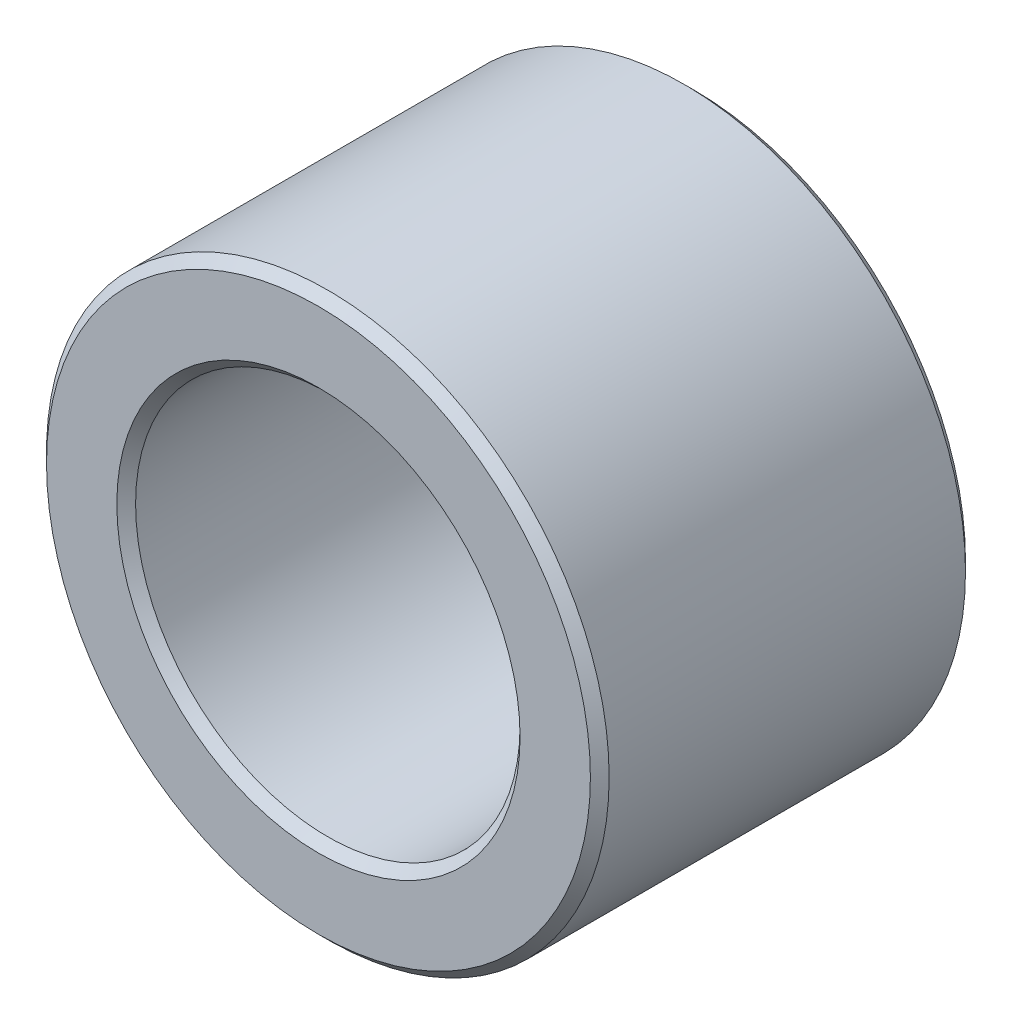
ISO-10303-21;
HEADER;
FILE_DESCRIPTION(('STEP AP214'),'2;1');
FILE_NAME('part.step','',(''),(''),'','','');
FILE_SCHEMA(('AUTOMOTIVE_DESIGN { 1 0 10303 214 1 1 1 1 }'));
ENDSEC;
DATA;
#1=APPLICATION_CONTEXT('core data for automotive mechanical design processes');
#2=APPLICATION_PROTOCOL_DEFINITION('international standard','automotive_design',2000,#1);
#3=PRODUCT_CONTEXT('',#1,'mechanical');
#4=PRODUCT('Part','Part','',(#3));
#5=PRODUCT_RELATED_PRODUCT_CATEGORY('part','',(#4));
#6=PRODUCT_DEFINITION_FORMATION('','',#4);
#7=PRODUCT_DEFINITION_CONTEXT('part definition',#1,'design');
#8=PRODUCT_DEFINITION('design','',#6,#7);
#9=PRODUCT_DEFINITION_SHAPE('','',#8);
#10=(LENGTH_UNIT() NAMED_UNIT(*) SI_UNIT(.MILLI.,.METRE.));
#11=(NAMED_UNIT(*) PLANE_ANGLE_UNIT() SI_UNIT($,.RADIAN.));
#12=(NAMED_UNIT(*) SI_UNIT($,.STERADIAN.) SOLID_ANGLE_UNIT());
#13=UNCERTAINTY_MEASURE_WITH_UNIT(LENGTH_MEASURE(1.E-05),#10,'distance_accuracy_value','');
#14=(GEOMETRIC_REPRESENTATION_CONTEXT(3) GLOBAL_UNCERTAINTY_ASSIGNED_CONTEXT((#13)) GLOBAL_UNIT_ASSIGNED_CONTEXT((#10,
#11,#12)) REPRESENTATION_CONTEXT('',''));
#15=CARTESIAN_POINT('',(0.,0.,0.));
#16=DIRECTION('',(0.,0.,1.));
#17=DIRECTION('',(1.,0.,0.));
#18=AXIS2_PLACEMENT_3D('',#15,#16,#17);
#19=CARTESIAN_POINT('',(0.,0.,4.));
#20=DIRECTION('',(0.,0.,1.));
#21=DIRECTION('',(1.,0.,0.));
#22=AXIS2_PLACEMENT_3D('',#19,#20,#21);
#23=PLANE('',#22);
#24=CARTESIAN_POINT('',(0.,0.,4.));
#25=DIRECTION('',(0.,0.,1.));
#26=DIRECTION('',(1.,0.,0.));
#27=AXIS2_PLACEMENT_3D('',#24,#25,#26);
#28=CIRCLE('',#27,4.3);
#29=CARTESIAN_POINT('',(4.3,0.,4.));
#30=VERTEX_POINT('',#29);
#31=EDGE_CURVE('E10',#30,#30,#28,.F.);
#32=ORIENTED_EDGE('',*,*,#31,.T.);
#33=EDGE_LOOP('',(#32));
#34=FACE_BOUND('',#33,.T.);
#35=CARTESIAN_POINT('',(0.,0.,4.));
#36=DIRECTION('',(0.,0.,1.));
#37=DIRECTION('',(1.,0.,0.));
#38=AXIS2_PLACEMENT_3D('',#35,#36,#37);
#39=CIRCLE('',#38,5.8);
#40=CARTESIAN_POINT('',(5.8,0.,4.));
#41=VERTEX_POINT('',#40);
#42=EDGE_CURVE('E45',#41,#41,#39,.T.);
#43=ORIENTED_EDGE('',*,*,#42,.T.);
#44=EDGE_LOOP('',(#43));
#45=FACE_BOUND('',#44,.T.);
#46=ADVANCED_FACE('F37',(#34,#45),#23,.T.);
#47=CARTESIAN_POINT('',(0.,0.,-4.));
#48=DIRECTION('',(0.,0.,1.));
#49=DIRECTION('',(1.,0.,0.));
#50=AXIS2_PLACEMENT_3D('',#47,#48,#49);
#51=PLANE('',#50);
#52=CARTESIAN_POINT('',(0.,0.,-4.));
#53=DIRECTION('',(0.,0.,1.));
#54=DIRECTION('',(1.,0.,0.));
#55=AXIS2_PLACEMENT_3D('',#52,#53,#54);
#56=CIRCLE('',#55,5.8);
#57=CARTESIAN_POINT('',(5.8,0.,-4.));
#58=VERTEX_POINT('',#57);
#59=EDGE_CURVE('E62',#58,#58,#56,.F.);
#60=ORIENTED_EDGE('',*,*,#59,.T.);
#61=EDGE_LOOP('',(#60));
#62=FACE_BOUND('',#61,.T.);
#63=CARTESIAN_POINT('',(0.,0.,-4.));
#64=DIRECTION('',(0.,0.,1.));
#65=DIRECTION('',(1.,0.,0.));
#66=AXIS2_PLACEMENT_3D('',#63,#64,#65);
#67=CIRCLE('',#66,4.3);
#68=CARTESIAN_POINT('',(-4.3,0.,-4.));
#69=VERTEX_POINT('',#68);
#70=EDGE_CURVE('E66',#69,#69,#67,.T.);
#71=ORIENTED_EDGE('',*,*,#70,.T.);
#72=EDGE_LOOP('',(#71));
#73=FACE_BOUND('',#72,.T.);
#74=ADVANCED_FACE('F89',(#62,#73),#51,.F.);
#75=CARTESIAN_POINT('',(0.,0.,4.));
#76=DIRECTION('',(0.,0.,-1.));
#77=DIRECTION('',(-1.,0.,0.));
#78=AXIS2_PLACEMENT_3D('',#75,#76,#77);
#79=CYLINDRICAL_SURFACE('',#78,6.);
#80=CARTESIAN_POINT('',(0.,0.,-3.8));
#81=DIRECTION('',(0.,0.,1.));
#82=DIRECTION('',(1.,0.,0.));
#83=AXIS2_PLACEMENT_3D('',#80,#81,#82);
#84=CIRCLE('',#83,6.);
#85=CARTESIAN_POINT('',(6.,0.,-3.8));
#86=VERTEX_POINT('',#85);
#87=EDGE_CURVE('E70',#86,#86,#84,.T.);
#88=ORIENTED_EDGE('',*,*,#87,.T.);
#89=EDGE_LOOP('',(#88));
#90=FACE_BOUND('',#89,.T.);
#91=CARTESIAN_POINT('',(0.,0.,3.8));
#92=DIRECTION('',(0.,0.,1.));
#93=DIRECTION('',(1.,0.,0.));
#94=AXIS2_PLACEMENT_3D('',#91,#92,#93);
#95=CIRCLE('',#94,6.);
#96=CARTESIAN_POINT('',(6.,0.,3.8));
#97=VERTEX_POINT('',#96);
#98=EDGE_CURVE('E74',#97,#97,#95,.F.);
#99=ORIENTED_EDGE('',*,*,#98,.T.);
#100=EDGE_LOOP('',(#99));
#101=FACE_BOUND('',#100,.T.);
#102=ADVANCED_FACE('F78',(#90,#101),#79,.T.);
#103=CARTESIAN_POINT('',(0.,0.,4.));
#104=DIRECTION('',(0.,0.,-1.));
#105=DIRECTION('',(-1.,0.,0.));
#106=AXIS2_PLACEMENT_3D('',#103,#104,#105);
#107=CYLINDRICAL_SURFACE('',#106,4.1);
#108=CARTESIAN_POINT('',(0.,0.,-3.8));
#109=DIRECTION('',(0.,0.,1.));
#110=DIRECTION('',(1.,0.,0.));
#111=AXIS2_PLACEMENT_3D('',#108,#109,#110);
#112=CIRCLE('',#111,4.1);
#113=CARTESIAN_POINT('',(-4.1,0.,-3.8));
#114=VERTEX_POINT('',#113);
#115=EDGE_CURVE('E51',#114,#114,#112,.F.);
#116=ORIENTED_EDGE('',*,*,#115,.T.);
#117=EDGE_LOOP('',(#116));
#118=FACE_BOUND('',#117,.T.);
#119=CARTESIAN_POINT('',(0.,0.,3.8));
#120=DIRECTION('',(0.,0.,1.));
#121=DIRECTION('',(1.,0.,0.));
#122=AXIS2_PLACEMENT_3D('',#119,#120,#121);
#123=CIRCLE('',#122,4.1);
#124=CARTESIAN_POINT('',(4.1,0.,3.8));
#125=VERTEX_POINT('',#124);
#126=EDGE_CURVE('E57',#125,#125,#123,.T.);
#127=ORIENTED_EDGE('',*,*,#126,.T.);
#128=EDGE_LOOP('',(#127));
#129=FACE_BOUND('',#128,.T.);
#130=ADVANCED_FACE('F97',(#118,#129),#107,.F.);
#131=CARTESIAN_POINT('',(0.,0.,-3.8));
#132=DIRECTION('',(0.,0.,1.));
#133=DIRECTION('',(1.,0.,0.));
#134=AXIS2_PLACEMENT_3D('',#131,#132,#133);
#135=CONICAL_SURFACE('',#134,6.,0.78539816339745);
#136=ORIENTED_EDGE('',*,*,#59,.F.);
#137=EDGE_LOOP('',(#136));
#138=FACE_BOUND('',#137,.T.);
#139=ORIENTED_EDGE('',*,*,#87,.F.);
#140=EDGE_LOOP('',(#139));
#141=FACE_BOUND('',#140,.T.);
#142=ADVANCED_FACE('F102',(#138,#141),#135,.T.);
#143=CARTESIAN_POINT('',(0.,0.,-4.));
#144=DIRECTION('',(0.,0.,-1.));
#145=DIRECTION('',(-1.,0.,0.));
#146=AXIS2_PLACEMENT_3D('',#143,#144,#145);
#147=CONICAL_SURFACE('',#146,4.3,0.785398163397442);
#148=CARTESIAN_POINT('',(-4.1,0.,-3.8));
#149=CARTESIAN_POINT('',(-4.10208333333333,0.,-3.80208333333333));
#150=CARTESIAN_POINT('',(-4.10416666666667,0.,-3.80416666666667));
#151=CARTESIAN_POINT('',(-4.10833333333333,0.,-3.80833333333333));
#152=CARTESIAN_POINT('',(-4.11041666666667,0.,-3.81041666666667));
#153=CARTESIAN_POINT('',(-4.11458333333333,0.,-3.81458333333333));
#154=CARTESIAN_POINT('',(-4.11666666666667,0.,-3.81666666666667));
#155=CARTESIAN_POINT('',(-4.12083333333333,0.,-3.82083333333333));
#156=CARTESIAN_POINT('',(-4.12291666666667,0.,-3.82291666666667));
#157=CARTESIAN_POINT('',(-4.12708333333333,0.,-3.82708333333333));
#158=CARTESIAN_POINT('',(-4.12916666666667,0.,-3.82916666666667));
#159=CARTESIAN_POINT('',(-4.13333333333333,0.,-3.83333333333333));
#160=CARTESIAN_POINT('',(-4.13541666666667,0.,-3.83541666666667));
#161=CARTESIAN_POINT('',(-4.13958333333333,0.,-3.83958333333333));
#162=CARTESIAN_POINT('',(-4.14166666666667,0.,-3.84166666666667));
#163=CARTESIAN_POINT('',(-4.14583333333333,0.,-3.84583333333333));
#164=CARTESIAN_POINT('',(-4.14791666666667,0.,-3.84791666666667));
#165=CARTESIAN_POINT('',(-4.15208333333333,0.,-3.85208333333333));
#166=CARTESIAN_POINT('',(-4.15416666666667,0.,-3.85416666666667));
#167=CARTESIAN_POINT('',(-4.15833333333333,0.,-3.85833333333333));
#168=CARTESIAN_POINT('',(-4.16041666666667,0.,-3.86041666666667));
#169=CARTESIAN_POINT('',(-4.16458333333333,0.,-3.86458333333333));
#170=CARTESIAN_POINT('',(-4.16666666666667,0.,-3.86666666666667));
#171=CARTESIAN_POINT('',(-4.17083333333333,0.,-3.87083333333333));
#172=CARTESIAN_POINT('',(-4.17291666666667,0.,-3.87291666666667));
#173=CARTESIAN_POINT('',(-4.17708333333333,0.,-3.87708333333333));
#174=CARTESIAN_POINT('',(-4.17916666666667,0.,-3.87916666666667));
#175=CARTESIAN_POINT('',(-4.18333333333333,0.,-3.88333333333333));
#176=CARTESIAN_POINT('',(-4.18541666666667,0.,-3.88541666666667));
#177=CARTESIAN_POINT('',(-4.18958333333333,0.,-3.88958333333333));
#178=CARTESIAN_POINT('',(-4.19166666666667,0.,-3.89166666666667));
#179=CARTESIAN_POINT('',(-4.19583333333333,0.,-3.89583333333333));
#180=CARTESIAN_POINT('',(-4.19791666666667,0.,-3.89791666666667));
#181=CARTESIAN_POINT('',(-4.20208333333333,0.,-3.90208333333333));
#182=CARTESIAN_POINT('',(-4.20416666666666,0.,-3.90416666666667));
#183=CARTESIAN_POINT('',(-4.20833333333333,0.,-3.90833333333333));
#184=CARTESIAN_POINT('',(-4.21041666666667,0.,-3.91041666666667));
#185=CARTESIAN_POINT('',(-4.21458333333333,0.,-3.91458333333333));
#186=CARTESIAN_POINT('',(-4.21666666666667,0.,-3.91666666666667));
#187=CARTESIAN_POINT('',(-4.22083333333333,0.,-3.92083333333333));
#188=CARTESIAN_POINT('',(-4.22291666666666,0.,-3.92291666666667));
#189=CARTESIAN_POINT('',(-4.22708333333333,0.,-3.92708333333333));
#190=CARTESIAN_POINT('',(-4.22916666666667,0.,-3.92916666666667));
#191=CARTESIAN_POINT('',(-4.23333333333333,0.,-3.93333333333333));
#192=CARTESIAN_POINT('',(-4.23541666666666,0.,-3.93541666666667));
#193=CARTESIAN_POINT('',(-4.23958333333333,0.,-3.93958333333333));
#194=CARTESIAN_POINT('',(-4.24166666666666,0.,-3.94166666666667));
#195=CARTESIAN_POINT('',(-4.24583333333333,0.,-3.94583333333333));
#196=CARTESIAN_POINT('',(-4.24791666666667,0.,-3.94791666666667));
#197=CARTESIAN_POINT('',(-4.25208333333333,0.,-3.95208333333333));
#198=CARTESIAN_POINT('',(-4.25416666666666,0.,-3.95416666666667));
#199=CARTESIAN_POINT('',(-4.25833333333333,0.,-3.95833333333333));
#200=CARTESIAN_POINT('',(-4.26041666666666,0.,-3.96041666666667));
#201=CARTESIAN_POINT('',(-4.26458333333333,0.,-3.96458333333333));
#202=CARTESIAN_POINT('',(-4.26666666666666,0.,-3.96666666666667));
#203=CARTESIAN_POINT('',(-4.27083333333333,0.,-3.97083333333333));
#204=CARTESIAN_POINT('',(-4.27291666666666,0.,-3.97291666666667));
#205=CARTESIAN_POINT('',(-4.27708333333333,0.,-3.97708333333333));
#206=CARTESIAN_POINT('',(-4.27916666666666,0.,-3.97916666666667));
#207=CARTESIAN_POINT('',(-4.28333333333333,0.,-3.98333333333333));
#208=CARTESIAN_POINT('',(-4.28541666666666,0.,-3.98541666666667));
#209=CARTESIAN_POINT('',(-4.28958333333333,0.,-3.98958333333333));
#210=CARTESIAN_POINT('',(-4.29166666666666,0.,-3.99166666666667));
#211=CARTESIAN_POINT('',(-4.29583333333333,0.,-3.99583333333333));
#212=CARTESIAN_POINT('',(-4.29791666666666,0.,-3.99791666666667));
#213=CARTESIAN_POINT('',(-4.3,0.,-4.));
#214=B_SPLINE_CURVE_WITH_KNOTS('',3,(#148,#149,#150,#151,#152,#153,#154,#155,#156,#157,#158,
#159,#160,#161,#162,#163,#164,#165,#166,#167,#168,#169,#170,#171,#172,#173,#174,#175,#176,#177,
#178,#179,#180,#181,#182,#183,#184,#185,#186,#187,#188,#189,#190,#191,#192,#193,#194,#195,#196,
#197,#198,#199,#200,#201,#202,#203,#204,#205,#206,#207,#208,#209,#210,#211,#212,#213),
.UNSPECIFIED.,.F.,.F.,(4,2,2,2,2,2,2,2,2,2,2,2,2,2,2,2,2,2,2,2,2,2,2,2,2,2,2,2,2,2,2,2,4),(0.,
0.00883883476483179,0.0176776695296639,0.0265165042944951,0.0353553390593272,0.044194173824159,
0.0530330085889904,0.0618718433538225,0.0707106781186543,0.0795495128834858,0.0883883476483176,
0.0972271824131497,0.106066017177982,0.114904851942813,0.123743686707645,0.132582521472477,
0.141421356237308,0.15026019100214,0.159099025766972,0.167937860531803,0.176776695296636,
0.185615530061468,0.1944543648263,0.203293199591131,0.212132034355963,0.220970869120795,
0.229809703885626,0.238648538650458,0.24748737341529,0.256326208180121,0.265165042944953,
0.274003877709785,0.282842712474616),.UNSPECIFIED.);
#215=EDGE_CURVE('BSEAM86',#114,#69,#214,.T.);
#216=ORIENTED_EDGE('',*,*,#115,.F.);
#217=ORIENTED_EDGE('',*,*,#70,.F.);
#218=ORIENTED_EDGE('',*,*,#215,.T.);
#219=ORIENTED_EDGE('',*,*,#215,.F.);
#220=EDGE_LOOP('',(#216,#218,#217,#219));
#221=FACE_BOUND('',#220,.T.);
#222=ADVANCED_FACE('F86',(#221),#147,.F.);
#223=CARTESIAN_POINT('',(0.,0.,3.8));
#224=DIRECTION('',(0.,0.,1.));
#225=DIRECTION('',(1.,0.,0.));
#226=AXIS2_PLACEMENT_3D('',#223,#224,#225);
#227=CONICAL_SURFACE('',#226,4.1,0.78539816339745);
#228=ORIENTED_EDGE('',*,*,#31,.F.);
#229=EDGE_LOOP('',(#228));
#230=FACE_BOUND('',#229,.T.);
#231=ORIENTED_EDGE('',*,*,#126,.F.);
#232=EDGE_LOOP('',(#231));
#233=FACE_BOUND('',#232,.T.);
#234=ADVANCED_FACE('F82',(#230,#233),#227,.F.);
#235=CARTESIAN_POINT('',(0.,0.,4.));
#236=DIRECTION('',(0.,0.,-1.));
#237=DIRECTION('',(-1.,0.,0.));
#238=AXIS2_PLACEMENT_3D('',#235,#236,#237);
#239=CONICAL_SURFACE('',#238,5.8,0.785398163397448);
#240=ORIENTED_EDGE('',*,*,#98,.F.);
#241=EDGE_LOOP('',(#240));
#242=FACE_BOUND('',#241,.T.);
#243=ORIENTED_EDGE('',*,*,#42,.F.);
#244=EDGE_LOOP('',(#243));
#245=FACE_BOUND('',#244,.T.);
#246=ADVANCED_FACE('F39',(#242,#245),#239,.T.);
#247=CLOSED_SHELL('',(#46,#74,#102,#130,#142,#222,#234,#246));
#248=MANIFOLD_SOLID_BREP('B2',#247);
#249=ADVANCED_BREP_SHAPE_REPRESENTATION('',(#18,#248),#14);
#250=SHAPE_DEFINITION_REPRESENTATION(#9,#249);
ENDSEC;
END-ISO-10303-21;
